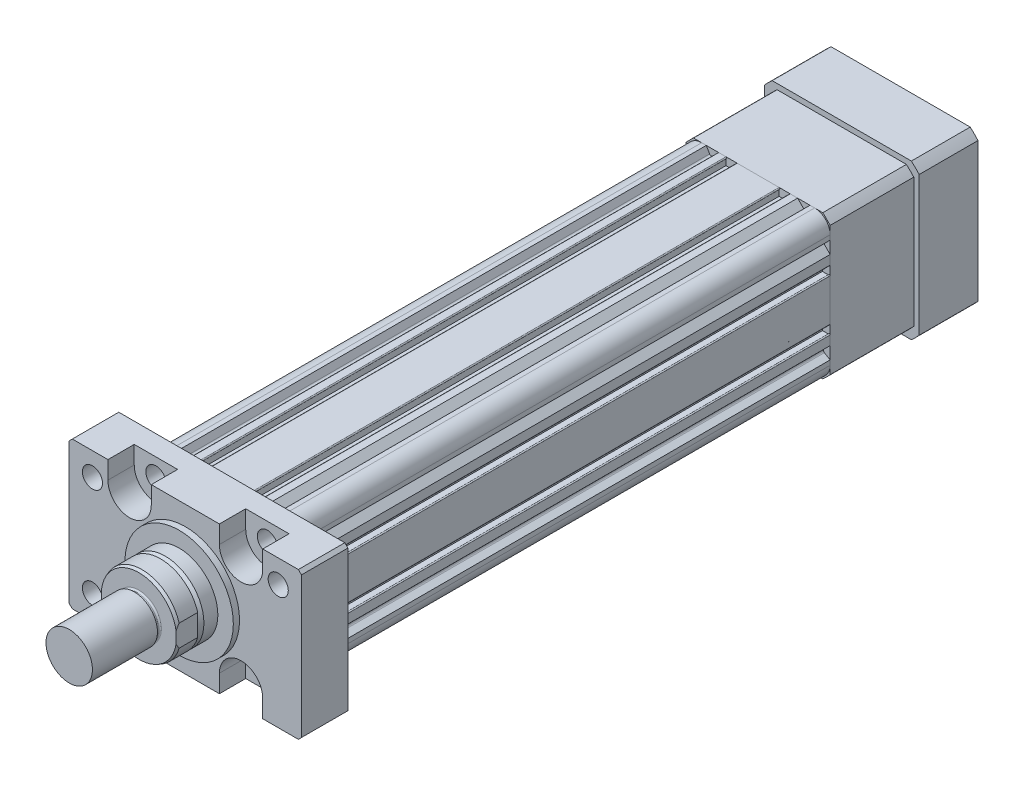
from build123d import *
from OCP.BRepFilletAPI import BRepFilletAPI_MakeChamfer

# Parameters (mm, degrees)
SKETCH_1_R          = 40
SKETCH_1_R_2        = 4.35
EXTRUDE_1_DEPTH     = 340
EXTRUDE_1_2_DEPTH   = 30
SKETCH_3_R          = 35
EXTRUDE_2_DEPTH     = 4
SKETCH_3_3_R        = 6.5
CUT_EXTRUDE_1_DEPTH = 30
SKETCH_3_4_R        = 6.5
CUT_EXTRUDE_2_DEPTH = 17
SKETCH_4_R          = 25
EXTRUDE_3_DEPTH     = 12
CHAMFER_1_SIZE      = 3
CHAMFER_1_SIZE2     = 1.732050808
EXTRUDE_4_DEPTH     = 14
CHAMFER_2_SIZE      = 2
CHAMFER_2_SIZE2     = 0.727940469
SKETCH_6_R          = 13.5
EXTRUDE_5_DEPTH     = 3
SKETCH_7_R          = 15
EXTRUDE_6_DEPTH     = 42
FILLET_1_R          = 1
EXTRUDE_7_DEPTH     = 54
EXTRUDE_8_DEPTH     = 38
SKETCH_10_R         = 40
CUT_EXTRUDE_3_DEPTH = 18.5
SKETCH_11_R         = 32
CUT_EXTRUDE_4_DEPTH = 15


with BuildPart() as part:
    # Sketch 1 → Extrude 1 (new body)
    with BuildSketch(Plane.XY):
        with BuildLine():
            Line((46.5, -36.5), (46.5, -33.5))
            Line((46.5, -33.5), (42.782554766, -31.353731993))
            ThreePointArc((42.782554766, -31.353731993), (42.192820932, -30.47113294), (42.534026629, -29.465973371))
            Line((42.534026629, -29.465973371), (46.5, -25.5))
            Line((46.5, -25.5), (46.5, -19.6))
            ThreePointArc((46.5, -19.6), (46.353553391, -19.246446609), (46, -19.1))
            ThreePointArc((46, -19.1), (45.646446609, -19.246446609), (45.5, -19.6))
            Line((45.5, -19.6), (41.5, -19.6))
            Line((41.5, -19.6), (41.5, -13.5))
            Line((41.5, -13.5), (45.5, -13.5))
            ThreePointArc((45.5, -13.5), (45.646446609, -13.853553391), (46, -14))
            ThreePointArc((46, -14), (46.353553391, -13.853553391), (46.5, -13.5))
            Line((46.5, -13.5), (46.5, 13.5))
            ThreePointArc((46.5, 13.5), (46.353553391, 13.853553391), (46, 14))
            ThreePointArc((46, 14), (45.646446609, 13.853553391), (45.5, 13.5))
            Line((45.5, 13.5), (41.5, 13.5))
            Line((41.5, 13.5), (41.5, 19.6))
            Line((41.5, 19.6), (45.5, 19.6))
            ThreePointArc((45.5, 19.6), (45.646446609, 19.246446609), (46, 19.1))
            ThreePointArc((46, 19.1), (46.353553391, 19.246446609), (46.5, 19.6))
            Line((46.5, 19.6), (46.5, 25.5))
            Line((46.5, 25.5), (42.534026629, 29.465973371))
            ThreePointArc((42.534026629, 29.465973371), (42.192820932, 30.47113294), (42.782554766, 31.353731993))
            Line((42.782554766, 31.353731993), (46.5, 33.5))
            Line((46.5, 33.5), (46.5, 36.5))
            ThreePointArc((46.5, 36.5), (43.571067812, 43.571067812), (36.5, 46.5))
            Line((36.5, 46.5), (33.5, 46.5))
            Line((33.5, 46.5), (31.353731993, 42.782554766))
            ThreePointArc((31.353731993, 42.782554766), (30.47113294, 42.192820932), (29.465973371, 42.534026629))
            Line((29.465973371, 42.534026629), (25.5, 46.5))
            Line((25.5, 46.5), (20.8, 46.5))
            ThreePointArc((20.8, 46.5), (20.446446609, 46.353553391), (20.3, 46))
            ThreePointArc((20.3, 46), (20.446446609, 45.646446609), (20.8, 45.5))
            Line((20.8, 45.5), (20.8, 41.5))
            Line((20.8, 41.5), (13.5, 41.5))
            Line((13.5, 41.5), (13.5, 45.5))
            ThreePointArc((13.5, 45.5), (13.853553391, 45.646446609), (14, 46))
            ThreePointArc((14, 46), (13.853553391, 46.353553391), (13.5, 46.5))
            Line((13.5, 46.5), (-13.5, 46.5))
            ThreePointArc((-13.5, 46.5), (-13.853553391, 46.353553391), (-14, 46))
            ThreePointArc((-14, 46), (-13.853553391, 45.646446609), (-13.5, 45.5))
            Line((-13.5, 45.5), (-13.5, 41.5))
            Line((-13.5, 41.5), (-20.8, 41.5))
            Line((-20.8, 41.5), (-20.8, 45.5))
            ThreePointArc((-20.8, 45.5), (-20.446446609, 45.646446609), (-20.3, 46))
            ThreePointArc((-20.3, 46), (-20.446446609, 46.353553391), (-20.8, 46.5))
            Line((-20.8, 46.5), (-25.5, 46.5))
            Line((-25.5, 46.5), (-29.465973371, 42.534026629))
            ThreePointArc((-29.465973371, 42.534026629), (-30.47113294, 42.192820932), (-31.353731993, 42.782554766))
            Line((-31.353731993, 42.782554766), (-33.5, 46.5))
            Line((-33.5, 46.5), (-36.5, 46.5))
            ThreePointArc((-36.5, 46.5), (-43.571067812, 43.571067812), (-46.5, 36.5))
            Line((-46.5, 36.5), (-46.5, 33.5))
            Line((-46.5, 33.5), (-42.782554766, 31.353731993))
            ThreePointArc((-42.782554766, 31.353731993), (-42.192820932, 30.47113294), (-42.534026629, 29.465973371))
            Line((-42.534026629, 29.465973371), (-46.5, 25.5))
            Line((-46.5, 25.5), (-46.5, 20))
            ThreePointArc((-46.5, 20), (-46.353553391, 19.646446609), (-46, 19.5))
            ThreePointArc((-46, 19.5), (-45.646446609, 19.646446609), (-45.5, 20))
            Line((-45.5, 20), (-41.5, 20))
            Line((-41.5, 20), (-41.5, 13.9))
            Line((-41.5, 13.9), (-45.5, 13.9))
            ThreePointArc((-45.5, 13.9), (-45.646446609, 14.253553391), (-46, 14.4))
            ThreePointArc((-46, 14.4), (-46.353553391, 14.253553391), (-46.5, 13.9))
            Line((-46.5, 13.9), (-46.5, -13.9))
            ThreePointArc((-46.5, -13.9), (-46.353553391, -14.253553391), (-46, -14.4))
            ThreePointArc((-46, -14.4), (-45.646446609, -14.253553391), (-45.5, -13.9))
            Line((-45.5, -13.9), (-41.5, -13.9))
            Line((-41.5, -13.9), (-41.5, -20))
            Line((-41.5, -20), (-45.5, -20))
            ThreePointArc((-45.5, -20), (-45.646446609, -19.646446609), (-46, -19.5))
            ThreePointArc((-46, -19.5), (-46.353553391, -19.646446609), (-46.5, -20))
            Line((-46.5, -20), (-46.5, -25.5))
            Line((-46.5, -25.5), (-42.534026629, -29.465973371))
            ThreePointArc((-42.534026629, -29.465973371), (-42.192820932, -30.47113294), (-42.782554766, -31.353731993))
            Line((-42.782554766, -31.353731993), (-46.5, -33.5))
            Line((-46.5, -33.5), (-46.5, -36.5))
            ThreePointArc((-46.5, -36.5), (-43.571067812, -43.571067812), (-36.5, -46.5))
            Line((-36.5, -46.5), (-33.5, -46.5))
            Line((-33.5, -46.5), (-31.353731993, -42.782554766))
            ThreePointArc((-31.353731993, -42.782554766), (-30.47113294, -42.192820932), (-29.465973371, -42.534026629))
            Line((-29.465973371, -42.534026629), (-25.5, -46.5))
            Line((-25.5, -46.5), (25.5, -46.5))
            Line((25.5, -46.5), (29.465973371, -42.534026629))
            ThreePointArc((29.465973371, -42.534026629), (30.47113294, -42.192820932), (31.353731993, -42.782554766))
            Line((31.353731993, -42.782554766), (33.5, -46.5))
            Line((33.5, -46.5), (36.5, -46.5))
            ThreePointArc((36.5, -46.5), (43.571067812, -43.571067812), (46.5, -36.5))
        make_face()
        Circle(SKETCH_1_R, mode=Mode.SUBTRACT)
        with Locations((36, -36)):
            Circle(SKETCH_1_R_2, mode=Mode.SUBTRACT)
        with Locations((-36, -36)):
            Circle(SKETCH_1_R_2, mode=Mode.SUBTRACT)
        with Locations((36, 36)):
            Circle(SKETCH_1_R_2, mode=Mode.SUBTRACT)
        with Locations((-36, 36)):
            Circle(SKETCH_1_R_2, mode=Mode.SUBTRACT)
        with BuildLine():
            Line((25.75, -42.5), (11.324751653, -42.5))
            ThreePointArc((11.324751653, -42.5), (10.829080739, -42.065653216), (11.194582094, -41.517241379))
            ThreePointArc((11.194582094, -41.517241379), (18.919894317, -38.613956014), (25.948275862, -34.288292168))
            ThreePointArc((25.948275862, -34.288292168), (26.472640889, -34.239297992), (26.75, -34.68699324))
            Line((26.75, -34.68699324), (26.75, -41.5))
            Line((26.75, -41.5), (25.75, -42.5))
        make_face(mode=Mode.SUBTRACT)
        with BuildLine():
            Line((-25.75, -42.5), (-11.324751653, -42.5))
            ThreePointArc((-11.324751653, -42.5), (-10.829080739, -42.065653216), (-11.194582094, -41.517241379))
            ThreePointArc((-11.194582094, -41.517241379), (-18.919894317, -38.613956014), (-25.948275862, -34.288292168))
            ThreePointArc((-25.948275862, -34.288292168), (-26.472640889, -34.239297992), (-26.75, -34.68699324))
            Line((-26.75, -34.68699324), (-26.75, -41.5))
            Line((-26.75, -41.5), (-25.75, -42.5))
        make_face(mode=Mode.SUBTRACT)
        with BuildLine():
            Line((26.312283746, 40), (20.798294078, 40))
            ThreePointArc((20.798294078, 40), (20.548294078, 39.933012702), (20.365281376, 39.75))
            Line((20.365281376, 39.75), (19.794336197, 38.761093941))
            ThreePointArc((19.794336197, 38.761093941), (19.747068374, 38.372059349), (19.994850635, 38.068437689))
            ThreePointArc((19.994850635, 38.068437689), (22.57372353, 36.598183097), (25.045011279, 34.953503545))
            ThreePointArc((25.045011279, 34.953503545), (25.441798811, 34.871210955), (25.769245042, 35.109939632))
            Line((25.769245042, 35.109939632), (27.64187192, 38.353424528))
            ThreePointArc((27.64187192, 38.353424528), (27.704581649, 38.668687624), (27.562412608, 38.956977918))
            Line((27.562412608, 38.956977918), (26.665837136, 39.853553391))
            ThreePointArc((26.665837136, 39.853553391), (26.503625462, 39.961939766), (26.312283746, 40))
        make_face(mode=Mode.SUBTRACT)
        with BuildLine():
            Line((38.956977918, 27.562412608), (39.853553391, 26.665837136))
            ThreePointArc((39.853553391, 26.665837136), (39.961939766, 26.503625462), (40, 26.312283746))
            Line((40, 26.312283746), (40, 20.798294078))
            ThreePointArc((40, 20.798294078), (39.933012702, 20.548294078), (39.75, 20.365281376))
            Line((39.75, 20.365281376), (38.761093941, 19.794336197))
            ThreePointArc((38.761093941, 19.794336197), (38.372059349, 19.747068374), (38.068437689, 19.994850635))
            ThreePointArc((38.068437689, 19.994850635), (36.598183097, 22.57372353), (34.953503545, 25.045011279))
            ThreePointArc((34.953503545, 25.045011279), (34.871210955, 25.441798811), (35.109939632, 25.769245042))
            Line((35.109939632, 25.769245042), (38.353424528, 27.64187192))
            ThreePointArc((38.353424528, 27.64187192), (38.668687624, 27.704581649), (38.956977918, 27.562412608))
        make_face(mode=Mode.SUBTRACT)
        with BuildLine():
            Line((38.956977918, -27.562412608), (39.853553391, -26.665837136))
            ThreePointArc((39.853553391, -26.665837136), (39.961939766, -26.503625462), (40, -26.312283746))
            Line((40, -26.312283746), (40, -20.798294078))
            ThreePointArc((40, -20.798294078), (39.933012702, -20.548294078), (39.75, -20.365281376))
            Line((39.75, -20.365281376), (38.761093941, -19.794336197))
            ThreePointArc((38.761093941, -19.794336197), (38.372059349, -19.747068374), (38.068437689, -19.994850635))
            ThreePointArc((38.068437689, -19.994850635), (36.598183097, -22.57372353), (34.953503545, -25.045011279))
            ThreePointArc((34.953503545, -25.045011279), (34.871210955, -25.441798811), (35.109939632, -25.769245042))
            Line((35.109939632, -25.769245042), (38.353424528, -27.64187192))
            ThreePointArc((38.353424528, -27.64187192), (38.668687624, -27.704581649), (38.956977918, -27.562412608))
        make_face(mode=Mode.SUBTRACT)
        with BuildLine():
            Line((-39.75, -20.365281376), (-38.761093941, -19.794336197))
            ThreePointArc((-38.761093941, -19.794336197), (-38.372059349, -19.747068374), (-38.068437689, -19.994850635))
            ThreePointArc((-38.068437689, -19.994850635), (-36.598183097, -22.57372353), (-34.953503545, -25.045011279))
            ThreePointArc((-34.953503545, -25.045011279), (-34.871210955, -25.441798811), (-35.109939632, -25.769245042))
            Line((-35.109939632, -25.769245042), (-38.353424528, -27.64187192))
            ThreePointArc((-38.353424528, -27.64187192), (-38.668687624, -27.704581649), (-38.956977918, -27.562412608))
            Line((-38.956977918, -27.562412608), (-39.853553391, -26.665837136))
            ThreePointArc((-39.853553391, -26.665837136), (-39.961939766, -26.503625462), (-40, -26.312283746))
            Line((-40, -26.312283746), (-40, -20.798294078))
            ThreePointArc((-40, -20.798294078), (-39.933012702, -20.548294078), (-39.75, -20.365281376))
        make_face(mode=Mode.SUBTRACT)
        with BuildLine():
            Line((-20.365281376, 39.75), (-19.794336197, 38.761093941))
            ThreePointArc((-19.794336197, 38.761093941), (-19.747068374, 38.372059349), (-19.994850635, 38.068437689))
            ThreePointArc((-19.994850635, 38.068437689), (-22.57372353, 36.598183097), (-25.045011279, 34.953503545))
            ThreePointArc((-25.045011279, 34.953503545), (-25.441798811, 34.871210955), (-25.769245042, 35.109939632))
            Line((-25.769245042, 35.109939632), (-27.64187192, 38.353424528))
            ThreePointArc((-27.64187192, 38.353424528), (-27.704581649, 38.668687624), (-27.562412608, 38.956977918))
            Line((-27.562412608, 38.956977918), (-26.665837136, 39.853553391))
            ThreePointArc((-26.665837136, 39.853553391), (-26.503625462, 39.961939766), (-26.312283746, 40))
            Line((-26.312283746, 40), (-20.798294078, 40))
            ThreePointArc((-20.798294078, 40), (-20.548294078, 39.933012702), (-20.365281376, 39.75))
        make_face(mode=Mode.SUBTRACT)
        with BuildLine():
            Line((-38.956977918, 27.562412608), (-39.853553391, 26.665837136))
            ThreePointArc((-39.853553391, 26.665837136), (-39.961939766, 26.503625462), (-40, 26.312283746))
            Line((-40, 26.312283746), (-40, 20.798294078))
            ThreePointArc((-40, 20.798294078), (-39.933012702, 20.548294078), (-39.75, 20.365281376))
            Line((-39.75, 20.365281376), (-38.761093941, 19.794336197))
            ThreePointArc((-38.761093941, 19.794336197), (-38.372059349, 19.747068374), (-38.068437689, 19.994850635))
            ThreePointArc((-38.068437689, 19.994850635), (-36.598183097, 22.57372353), (-34.953503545, 25.045011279))
            ThreePointArc((-34.953503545, 25.045011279), (-34.871210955, 25.441798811), (-35.109939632, 25.769245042))
            Line((-35.109939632, 25.769245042), (-38.353424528, 27.64187192))
            ThreePointArc((-38.353424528, 27.64187192), (-38.668687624, 27.704581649), (-38.956977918, 27.562412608))
        make_face(mode=Mode.SUBTRACT)
    extrude(amount=EXTRUDE_1_DEPTH)

    # Sketch 2 → Extrude 1 2 (add)
    with BuildSketch(Plane.XY.offset(340)):
        Polygon((-75, 45.5), (-73, 47.5), (73, 47.5), (75, 45.5), (75, -45.5), (73, -47.5), (-73, -47.5), (-75, -45.5), align=None)
    extrude(amount=EXTRUDE_1_2_DEPTH)

    # Sketch 3 → Extrude 2 (add)
    with BuildSketch(Plane.XY.offset(370)):
        Circle(SKETCH_3_R)
    extrude(amount=EXTRUDE_2_DEPTH)

    # Sketch 3_3 → Cut-Extrude 1 (cut)
    with BuildSketch(Plane.XY.offset(370)):
        with Locations((-36, 36)):
            Circle(SKETCH_3_3_R)
        with Locations((36, 36)):
            Circle(SKETCH_3_3_R)
        with Locations((60, 32.5)):
            Circle(SKETCH_3_3_R)
        with Locations((36, -36)):
            Circle(SKETCH_3_3_R)
        with Locations((-36, -36)):
            Circle(SKETCH_3_3_R)
        with Locations((-60, -32.5)):
            Circle(SKETCH_3_3_R)
        with Locations((-60, 32.5)):
            Circle(SKETCH_3_3_R)
    extrude(amount=-CUT_EXTRUDE_1_DEPTH, mode=Mode.SUBTRACT)

    # Sketch 3_4 → Cut-Extrude 2 (cut)
    # profile 1 of 4: a face of its own
    with BuildSketch(Plane.XY.offset(370)):
        with BuildLine():
            Line((50, 47.5), (22, 47.5))
            Line((22, 47.5), (22, 36))
            ThreePointArc((22, 36), (36, 22), (50, 36))
            Line((50, 36), (50, 47.5))
        make_face()
        with Locations((36, 36)):
            Circle(SKETCH_3_4_R, mode=Mode.SUBTRACT)
    # profile 2 of 4: a face of its own
    with BuildSketch(Plane.XY.offset(370)):
        with BuildLine():
            Line((50, -47.5), (50, -36))
            ThreePointArc((50, -36), (36, -22), (22, -36))
            Line((22, -36), (22, -47.5))
            Line((22, -47.5), (50, -47.5))
        make_face()
        with Locations((36, -36)):
            Circle(SKETCH_3_4_R, mode=Mode.SUBTRACT)
    # profile 3 of 4: a face of its own
    with BuildSketch(Plane.XY.offset(370)):
        with BuildLine():
            Line((-50, -47.5), (-22, -47.5))
            Line((-22, -47.5), (-22, -36))
            ThreePointArc((-22, -36), (-36, -22), (-50, -36))
            Line((-50, -36), (-50, -47.5))
        make_face()
        with Locations((-36, -36)):
            Circle(SKETCH_3_4_R, mode=Mode.SUBTRACT)
    # profile 4 of 4: a face of its own
    with BuildSketch(Plane.XY.offset(370)):
        with BuildLine():
            Line((-50, 36), (-50, 47.5))
            Line((-50, 47.5), (-22, 47.5))
            Line((-22, 47.5), (-22, 36))
            ThreePointArc((-22, 36), (-36, 22), (-50, 36))
        make_face()
    extrude(amount=-CUT_EXTRUDE_2_DEPTH, mode=Mode.SUBTRACT)

    # Sketch 4 → Extrude 3 (add)
    with BuildSketch(Plane.XY.offset(374)):
        Circle(SKETCH_4_R)
    extrude(amount=EXTRUDE_3_DEPTH)

    # Chamfer 1
    chamfer_1_edges = [part.edges().sort_by_distance(p)[0] for p in [
        (-25, 0, 386),
    ]]
    chamfer_1_side = [part.faces().sort_by_distance(p)[0] for p in [
        (-25, 0, 380),
    ]]
    chamfer(chamfer_1_edges, length=CHAMFER_1_SIZE, length2=CHAMFER_1_SIZE2, reference=chamfer_1_side[0])

    # Sketch 5 → Extrude 4 (add)
    with BuildSketch(Plane.XY.offset(386)):
        with BuildLine():
            Line((-24, 7), (-24, -7))
            ThreePointArc((-24, -7), (0, -25), (24, -7))
            Line((24, -7), (24, 7))
            ThreePointArc((24, 7), (0, 25), (-24, 7))
        make_face()
    extrude(amount=EXTRUDE_4_DEPTH)

    # Chamfer 2: one chamfer whose edges measure the first distance from different faces: ONE call of the kernel's chamfer builder (chamfer() names one face for all edges)
    chamfer_2_edges_1 = [part.edges().sort_by_distance(p)[0] for p in [
        (0, 25, 400),
    ]]
    chamfer_2_side_1 = [part.faces().sort_by_distance(p)[0] for p in [
        (0, 25, 393),
    ]]
    chamfer_2_edges_2 = [part.edges().sort_by_distance(p)[0] for p in [
        (0, -25, 400),
    ]]
    chamfer_2_side_2 = [part.faces().sort_by_distance(p)[0] for p in [
        (0, -25, 393),
    ]]
    chamfer_2 = BRepFilletAPI_MakeChamfer(part.part.solid().wrapped)
    for e in chamfer_2_edges_1:
        chamfer_2.Add(CHAMFER_2_SIZE, CHAMFER_2_SIZE2, e.wrapped, chamfer_2_side_1[0].wrapped)  # the first distance lies on this face
    for e in chamfer_2_edges_2:
        chamfer_2.Add(CHAMFER_2_SIZE, CHAMFER_2_SIZE2, e.wrapped, chamfer_2_side_2[0].wrapped)  # the first distance lies on this face
    add(Compound.cast(chamfer_2.Shape()), mode=Mode.REPLACE)

    # Sketch 6 → Extrude 5 (add)
    with BuildSketch(Plane.XY.offset(400)):
        Circle(SKETCH_6_R)
    extrude(amount=EXTRUDE_5_DEPTH)

    # Sketch 7 → Extrude 6 (add)
    with BuildSketch(Plane.XY.offset(403)):
        with Locations(Location((0, 0, 0), (0, 0, 180))):
            Circle(SKETCH_7_R)
    extrude(amount=EXTRUDE_6_DEPTH)

    # Fillet 1
    fillet_1_edges = [part.edges().sort_by_distance(p)[0] for p in [
        (-13.5, 0, 400),
    ]]
    fillet(fillet_1_edges, radius=FILLET_1_R)


with BuildPart() as body_2:
    # Sketch 8 → Extrude 7 (new body)
    with BuildSketch(Plane(origin=(0, 0, 0), x_dir=(-1, 0, 0), z_dir=(0, 0, -1))):
        with BuildLine():
            Line((-41.761226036, 46.5), (41.761226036, 46.5))
            ThreePointArc((41.761226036, 46.5), (44.194173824, 44.194173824), (46.5, 41.761226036))
            Line((46.5, 41.761226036), (46.5, -41.761226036))
            ThreePointArc((46.5, -41.761226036), (44.194173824, -44.194173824), (41.761226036, -46.5))
            Line((41.761226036, -46.5), (-41.761226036, -46.5))
            ThreePointArc((-41.761226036, -46.5), (-44.194173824, -44.194173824), (-46.5, -41.761226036))
            Line((-46.5, -41.761226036), (-46.5, 41.761226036))
            ThreePointArc((-46.5, 41.761226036), (-44.194173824, 44.194173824), (-41.761226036, 46.5))
        make_face()
    extrude(amount=EXTRUDE_7_DEPTH)

    # Sketch 9 → Extrude 8 (add)
    with BuildSketch(Plane(origin=(0, 0, -54), x_dir=(-1, 0, 0), z_dir=(0, 0, -1))):
        with BuildLine():
            Line((-44.972908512, 50), (44.972908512, 50))
            ThreePointArc((44.972908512, 50), (47.552931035, 47.552931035), (50, 44.972908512))
            Line((50, 44.972908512), (50, -44.972908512))
            ThreePointArc((50, -44.972908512), (47.552931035, -47.552931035), (44.972908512, -50))
            Line((44.972908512, -50), (-44.972908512, -50))
            ThreePointArc((-44.972908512, -50), (-47.552931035, -47.552931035), (-50, -44.972908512))
            Line((-50, -44.972908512), (-50, 44.972908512))
            ThreePointArc((-50, 44.972908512), (-47.552931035, 47.552931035), (-44.972908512, 50))
        make_face()
    extrude(amount=EXTRUDE_8_DEPTH)

    # Sketch 10 → Cut-Extrude 3 (cut)
    with BuildSketch(Plane(origin=(0, 0, -92), x_dir=(-1, 0, 0), z_dir=(0, 0, -1))):
        Circle(SKETCH_10_R)
    extrude(amount=-CUT_EXTRUDE_3_DEPTH, mode=Mode.SUBTRACT)

    # Sketch 11 → Cut-Extrude 4 (cut)
    with BuildSketch(Plane(origin=(0, 0, -73.5), x_dir=(-1, 0, 0), z_dir=(0, 0, -1))):
        Circle(SKETCH_11_R)
    extrude(amount=-CUT_EXTRUDE_4_DEPTH, mode=Mode.SUBTRACT)


solid = Compound([part.part, body_2.part])
